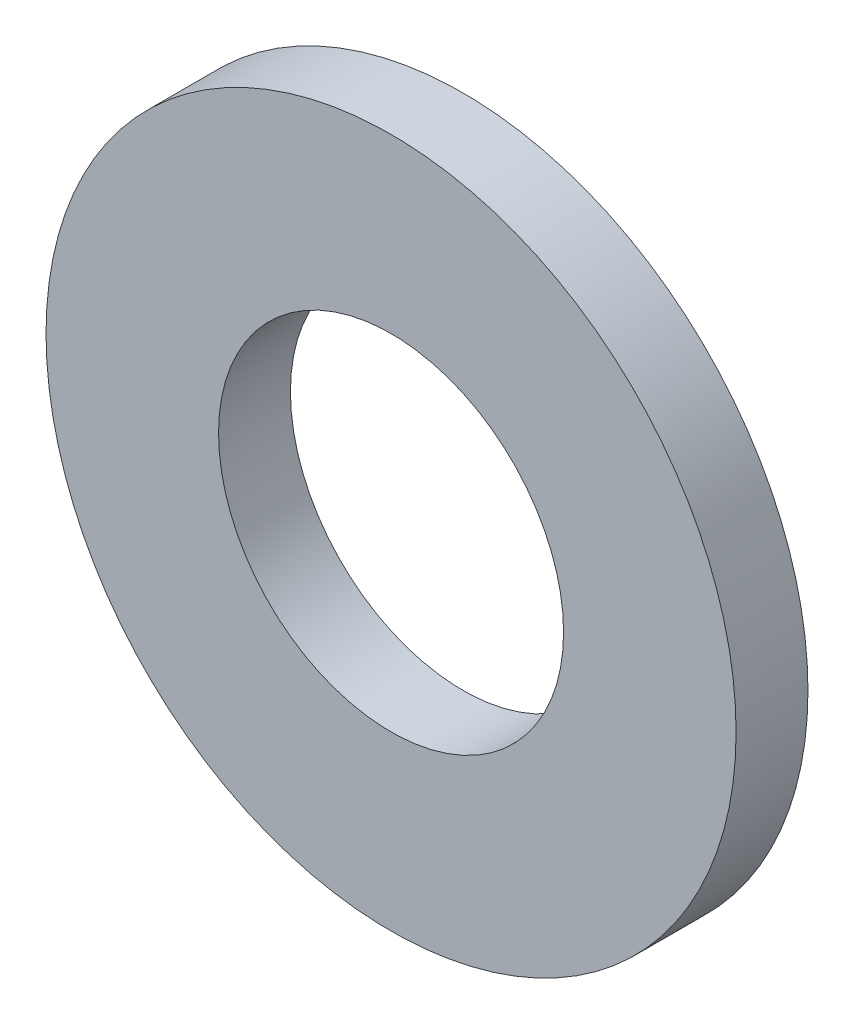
ISO-10303-21;
HEADER;
FILE_DESCRIPTION(('STEP AP214'),'2;1');
FILE_NAME('part.step','',(''),(''),'','','');
FILE_SCHEMA(('AUTOMOTIVE_DESIGN { 1 0 10303 214 1 1 1 1 }'));
ENDSEC;
DATA;
#1=APPLICATION_CONTEXT('core data for automotive mechanical design processes');
#2=APPLICATION_PROTOCOL_DEFINITION('international standard','automotive_design',2000,#1);
#3=PRODUCT_CONTEXT('',#1,'mechanical');
#4=PRODUCT('Part','Part','',(#3));
#5=PRODUCT_RELATED_PRODUCT_CATEGORY('part','',(#4));
#6=PRODUCT_DEFINITION_FORMATION('','',#4);
#7=PRODUCT_DEFINITION_CONTEXT('part definition',#1,'design');
#8=PRODUCT_DEFINITION('design','',#6,#7);
#9=PRODUCT_DEFINITION_SHAPE('','',#8);
#10=(LENGTH_UNIT() NAMED_UNIT(*) SI_UNIT(.MILLI.,.METRE.));
#11=(NAMED_UNIT(*) PLANE_ANGLE_UNIT() SI_UNIT($,.RADIAN.));
#12=(NAMED_UNIT(*) SI_UNIT($,.STERADIAN.) SOLID_ANGLE_UNIT());
#13=UNCERTAINTY_MEASURE_WITH_UNIT(LENGTH_MEASURE(1.E-05),#10,'distance_accuracy_value','');
#14=(GEOMETRIC_REPRESENTATION_CONTEXT(3) GLOBAL_UNCERTAINTY_ASSIGNED_CONTEXT((#13)) GLOBAL_UNIT_ASSIGNED_CONTEXT((#10,
#11,#12)) REPRESENTATION_CONTEXT('',''));
#15=CARTESIAN_POINT('',(0.,0.,0.));
#16=DIRECTION('',(0.,0.,1.));
#17=DIRECTION('',(1.,0.,0.));
#18=AXIS2_PLACEMENT_3D('',#15,#16,#17);
#19=CARTESIAN_POINT('',(0.,0.,1.25));
#20=DIRECTION('',(0.,0.,1.));
#21=DIRECTION('',(1.,0.,0.));
#22=AXIS2_PLACEMENT_3D('',#19,#20,#21);
#23=PLANE('',#22);
#24=CARTESIAN_POINT('',(0.,0.,1.25));
#25=DIRECTION('',(0.,0.,1.));
#26=DIRECTION('',(1.,0.,0.));
#27=AXIS2_PLACEMENT_3D('',#24,#25,#26);
#28=CIRCLE('',#27,6.);
#29=CARTESIAN_POINT('',(6.,0.,1.25));
#30=VERTEX_POINT('',#29);
#31=EDGE_CURVE('E10',#30,#30,#28,.T.);
#32=ORIENTED_EDGE('',*,*,#31,.T.);
#33=EDGE_LOOP('',(#32));
#34=FACE_BOUND('',#33,.T.);
#35=CARTESIAN_POINT('',(0.,0.,1.25));
#36=DIRECTION('',(0.,0.,1.));
#37=DIRECTION('',(1.,0.,0.));
#38=AXIS2_PLACEMENT_3D('',#35,#36,#37);
#39=CIRCLE('',#38,3.);
#40=CARTESIAN_POINT('',(3.,0.,1.25));
#41=VERTEX_POINT('',#40);
#42=EDGE_CURVE('E359',#41,#41,#39,.T.);
#43=ORIENTED_EDGE('',*,*,#42,.F.);
#44=EDGE_LOOP('',(#43));
#45=FACE_BOUND('',#44,.T.);
#46=ADVANCED_FACE('F348',(#34,#45),#23,.T.);
#47=CARTESIAN_POINT('',(0.,0.,0.));
#48=DIRECTION('',(0.,0.,1.));
#49=DIRECTION('',(1.,0.,0.));
#50=AXIS2_PLACEMENT_3D('',#47,#48,#49);
#51=PLANE('',#50);
#52=CARTESIAN_POINT('',(0.,0.,0.));
#53=DIRECTION('',(0.,0.,1.));
#54=DIRECTION('',(1.,0.,0.));
#55=AXIS2_PLACEMENT_3D('',#52,#53,#54);
#56=CIRCLE('',#55,6.);
#57=CARTESIAN_POINT('',(6.,0.,0.));
#58=VERTEX_POINT('',#57);
#59=EDGE_CURVE('E355',#58,#58,#56,.T.);
#60=ORIENTED_EDGE('',*,*,#59,.F.);
#61=EDGE_LOOP('',(#60));
#62=FACE_BOUND('',#61,.T.);
#63=CARTESIAN_POINT('',(0.,0.,0.));
#64=DIRECTION('',(0.,0.,1.));
#65=DIRECTION('',(1.,0.,0.));
#66=AXIS2_PLACEMENT_3D('',#63,#64,#65);
#67=CIRCLE('',#66,3.);
#68=CARTESIAN_POINT('',(3.,0.,0.));
#69=VERTEX_POINT('',#68);
#70=EDGE_CURVE('E363',#69,#69,#67,.T.);
#71=ORIENTED_EDGE('',*,*,#70,.T.);
#72=EDGE_LOOP('',(#71));
#73=FACE_BOUND('',#72,.T.);
#74=ADVANCED_FACE('F369',(#62,#73),#51,.F.);
#75=CARTESIAN_POINT('',(0.,0.,1.25));
#76=DIRECTION('',(0.,0.,-1.));
#77=DIRECTION('',(-1.,0.,0.));
#78=AXIS2_PLACEMENT_3D('',#75,#76,#77);
#79=CYLINDRICAL_SURFACE('',#78,6.);
#80=ORIENTED_EDGE('',*,*,#31,.F.);
#81=EDGE_LOOP('',(#80));
#82=FACE_BOUND('',#81,.T.);
#83=ORIENTED_EDGE('',*,*,#59,.T.);
#84=EDGE_LOOP('',(#83));
#85=FACE_BOUND('',#84,.T.);
#86=ADVANCED_FACE('F350',(#82,#85),#79,.T.);
#87=CARTESIAN_POINT('',(0.,0.,1.25));
#88=DIRECTION('',(0.,0.,-1.));
#89=DIRECTION('',(-1.,0.,0.));
#90=AXIS2_PLACEMENT_3D('',#87,#88,#89);
#91=CYLINDRICAL_SURFACE('',#90,3.);
#92=ORIENTED_EDGE('',*,*,#42,.T.);
#93=EDGE_LOOP('',(#92));
#94=FACE_BOUND('',#93,.T.);
#95=ORIENTED_EDGE('',*,*,#70,.F.);
#96=EDGE_LOOP('',(#95));
#97=FACE_BOUND('',#96,.T.);
#98=ADVANCED_FACE('F371',(#94,#97),#91,.F.);
#99=CLOSED_SHELL('',(#46,#74,#86,#98));
#100=MANIFOLD_SOLID_BREP('B2',#99);
#101=ADVANCED_BREP_SHAPE_REPRESENTATION('',(#18,#100),#14);
#102=SHAPE_DEFINITION_REPRESENTATION(#9,#101);
ENDSEC;
END-ISO-10303-21;
